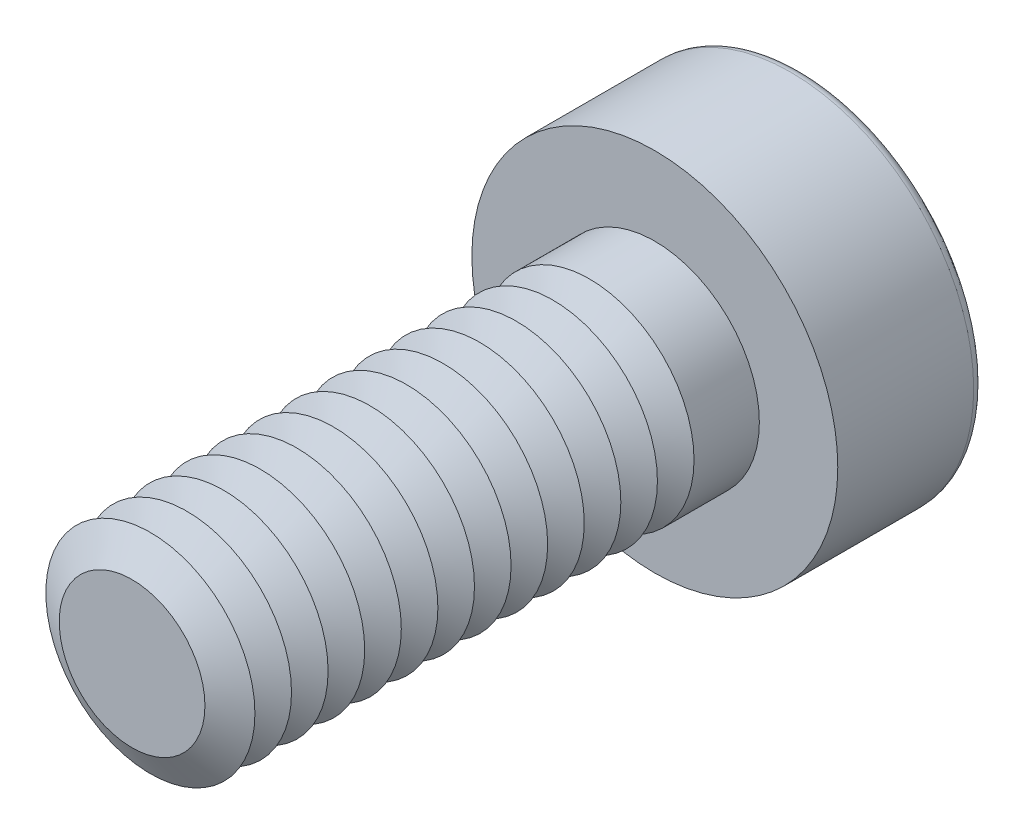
ISO-10303-21;
HEADER;
FILE_DESCRIPTION(('STEP AP214'),'2;1');
FILE_NAME('part.step','',(''),(''),'','','');
FILE_SCHEMA(('AUTOMOTIVE_DESIGN { 1 0 10303 214 1 1 1 1 }'));
ENDSEC;
DATA;
#1=APPLICATION_CONTEXT('core data for automotive mechanical design processes');
#2=APPLICATION_PROTOCOL_DEFINITION('international standard','automotive_design',2000,#1);
#3=PRODUCT_CONTEXT('',#1,'mechanical');
#4=PRODUCT('Part','Part','',(#3));
#5=PRODUCT_RELATED_PRODUCT_CATEGORY('part','',(#4));
#6=PRODUCT_DEFINITION_FORMATION('','',#4);
#7=PRODUCT_DEFINITION_CONTEXT('part definition',#1,'design');
#8=PRODUCT_DEFINITION('design','',#6,#7);
#9=PRODUCT_DEFINITION_SHAPE('','',#8);
#10=(LENGTH_UNIT() NAMED_UNIT(*) SI_UNIT(.MILLI.,.METRE.));
#11=(NAMED_UNIT(*) PLANE_ANGLE_UNIT() SI_UNIT($,.RADIAN.));
#12=(NAMED_UNIT(*) SI_UNIT($,.STERADIAN.) SOLID_ANGLE_UNIT());
#13=UNCERTAINTY_MEASURE_WITH_UNIT(LENGTH_MEASURE(1.E-05),#10,'distance_accuracy_value','');
#14=(GEOMETRIC_REPRESENTATION_CONTEXT(3) GLOBAL_UNCERTAINTY_ASSIGNED_CONTEXT((#13)) GLOBAL_UNIT_ASSIGNED_CONTEXT((#10,
#11,#12)) REPRESENTATION_CONTEXT('',''));
#15=CARTESIAN_POINT('',(0.,0.,0.));
#16=DIRECTION('',(0.,0.,1.));
#17=DIRECTION('',(1.,0.,0.));
#18=AXIS2_PLACEMENT_3D('',#15,#16,#17);
#19=CARTESIAN_POINT('',(0.,0.,7.55));
#20=DIRECTION('',(0.,0.,1.));
#21=DIRECTION('',(1.,0.,0.));
#22=AXIS2_PLACEMENT_3D('',#19,#20,#21);
#23=CONICAL_SURFACE('',#22,2.,1.0471975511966);
#24=CARTESIAN_POINT('',(0.,0.,7.2));
#25=DIRECTION('',(0.,0.,1.));
#26=DIRECTION('',(1.,0.,0.));
#27=AXIS2_PLACEMENT_3D('',#24,#25,#26);
#28=CIRCLE('',#27,1.39378221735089);
#29=CARTESIAN_POINT('',(1.39378221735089,0.,7.2));
#30=VERTEX_POINT('',#29);
#31=EDGE_CURVE('E314',#30,#30,#28,.T.);
#32=ORIENTED_EDGE('',*,*,#31,.T.);
#33=EDGE_LOOP('',(#32));
#34=FACE_BOUND('',#33,.T.);
#35=CARTESIAN_POINT('',(0.,0.,7.55));
#36=DIRECTION('',(0.,0.,1.));
#37=DIRECTION('',(1.,0.,0.));
#38=AXIS2_PLACEMENT_3D('',#35,#36,#37);
#39=CIRCLE('',#38,2.);
#40=CARTESIAN_POINT('',(2.,0.,7.55));
#41=VERTEX_POINT('',#40);
#42=EDGE_CURVE('E317',#41,#41,#39,.T.);
#43=ORIENTED_EDGE('',*,*,#42,.F.);
#44=EDGE_LOOP('',(#43));
#45=FACE_BOUND('',#44,.T.);
#46=ADVANCED_FACE('F39',(#34,#45),#23,.T.);
#47=CARTESIAN_POINT('',(0.,0.,7.2));
#48=DIRECTION('',(0.,0.,-1.));
#49=DIRECTION('',(-1.,0.,0.));
#50=AXIS2_PLACEMENT_3D('',#47,#48,#49);
#51=CONICAL_SURFACE('',#50,1.39378221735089,1.0471975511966);
#52=CARTESIAN_POINT('',(0.,0.,6.85));
#53=DIRECTION('',(0.,0.,1.));
#54=DIRECTION('',(1.,0.,0.));
#55=AXIS2_PLACEMENT_3D('',#52,#53,#54);
#56=CIRCLE('',#55,2.);
#57=CARTESIAN_POINT('',(2.,0.,6.85));
#58=VERTEX_POINT('',#57);
#59=EDGE_CURVE('E325',#58,#58,#56,.T.);
#60=ORIENTED_EDGE('',*,*,#59,.T.);
#61=EDGE_LOOP('',(#60));
#62=FACE_BOUND('',#61,.T.);
#63=ORIENTED_EDGE('',*,*,#31,.F.);
#64=EDGE_LOOP('',(#63));
#65=FACE_BOUND('',#64,.T.);
#66=ADVANCED_FACE('F245',(#62,#65),#51,.T.);
#67=CARTESIAN_POINT('',(0.,0.,10.));
#68=DIRECTION('',(0.,0.,1.));
#69=DIRECTION('',(1.,0.,0.));
#70=AXIS2_PLACEMENT_3D('',#67,#68,#69);
#71=PLANE('',#70);
#72=CARTESIAN_POINT('',(0.,0.,10.));
#73=DIRECTION('',(0.,0.,1.));
#74=DIRECTION('',(1.,0.,0.));
#75=AXIS2_PLACEMENT_3D('',#72,#73,#74);
#76=CIRCLE('',#75,1.39378221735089);
#77=CARTESIAN_POINT('',(1.39378221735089,0.,10.));
#78=VERTEX_POINT('',#77);
#79=EDGE_CURVE('E174',#78,#78,#76,.T.);
#80=ORIENTED_EDGE('',*,*,#79,.T.);
#81=EDGE_LOOP('',(#80));
#82=FACE_BOUND('',#81,.T.);
#83=ADVANCED_FACE('F251',(#82),#71,.T.);
#84=CARTESIAN_POINT('',(0.,0.,10.));
#85=DIRECTION('',(0.,0.,-1.));
#86=DIRECTION('',(-1.,0.,0.));
#87=AXIS2_PLACEMENT_3D('',#84,#85,#86);
#88=CONICAL_SURFACE('',#87,1.39378221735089,1.0471975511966);
#89=CARTESIAN_POINT('',(0.,0.,9.65));
#90=DIRECTION('',(0.,0.,1.));
#91=DIRECTION('',(1.,0.,0.));
#92=AXIS2_PLACEMENT_3D('',#89,#90,#91);
#93=CIRCLE('',#92,2.);
#94=CARTESIAN_POINT('',(2.,0.,9.65));
#95=VERTEX_POINT('',#94);
#96=EDGE_CURVE('E291',#95,#95,#93,.T.);
#97=ORIENTED_EDGE('',*,*,#96,.T.);
#98=EDGE_LOOP('',(#97));
#99=FACE_BOUND('',#98,.T.);
#100=ORIENTED_EDGE('',*,*,#79,.F.);
#101=EDGE_LOOP('',(#100));
#102=FACE_BOUND('',#101,.T.);
#103=ADVANCED_FACE('F199',(#99,#102),#88,.T.);
#104=CARTESIAN_POINT('',(0.,0.,9.65));
#105=DIRECTION('',(0.,0.,1.));
#106=DIRECTION('',(1.,0.,0.));
#107=AXIS2_PLACEMENT_3D('',#104,#105,#106);
#108=CONICAL_SURFACE('',#107,2.,1.0471975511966);
#109=CARTESIAN_POINT('',(0.,0.,9.3));
#110=DIRECTION('',(0.,0.,1.));
#111=DIRECTION('',(1.,0.,0.));
#112=AXIS2_PLACEMENT_3D('',#109,#110,#111);
#113=CIRCLE('',#112,1.39378221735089);
#114=CARTESIAN_POINT('',(1.39378221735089,0.,9.3));
#115=VERTEX_POINT('',#114);
#116=EDGE_CURVE('E288',#115,#115,#113,.T.);
#117=ORIENTED_EDGE('',*,*,#116,.T.);
#118=EDGE_LOOP('',(#117));
#119=FACE_BOUND('',#118,.T.);
#120=ORIENTED_EDGE('',*,*,#96,.F.);
#121=EDGE_LOOP('',(#120));
#122=FACE_BOUND('',#121,.T.);
#123=ADVANCED_FACE('F277',(#119,#122),#108,.T.);
#124=CARTESIAN_POINT('',(0.,0.,9.3));
#125=DIRECTION('',(0.,0.,-1.));
#126=DIRECTION('',(-1.,0.,0.));
#127=AXIS2_PLACEMENT_3D('',#124,#125,#126);
#128=CONICAL_SURFACE('',#127,1.39378221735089,1.0471975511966);
#129=CARTESIAN_POINT('',(0.,0.,8.95));
#130=DIRECTION('',(0.,0.,1.));
#131=DIRECTION('',(1.,0.,0.));
#132=AXIS2_PLACEMENT_3D('',#129,#130,#131);
#133=CIRCLE('',#132,2.);
#134=CARTESIAN_POINT('',(2.,0.,8.95));
#135=VERTEX_POINT('',#134);
#136=EDGE_CURVE('E300',#135,#135,#133,.T.);
#137=ORIENTED_EDGE('',*,*,#136,.T.);
#138=EDGE_LOOP('',(#137));
#139=FACE_BOUND('',#138,.T.);
#140=ORIENTED_EDGE('',*,*,#116,.F.);
#141=EDGE_LOOP('',(#140));
#142=FACE_BOUND('',#141,.T.);
#143=ADVANCED_FACE('F274',(#139,#142),#128,.T.);
#144=CARTESIAN_POINT('',(0.,0.,8.95));
#145=DIRECTION('',(0.,0.,1.));
#146=DIRECTION('',(1.,0.,0.));
#147=AXIS2_PLACEMENT_3D('',#144,#145,#146);
#148=CONICAL_SURFACE('',#147,2.,1.0471975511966);
#149=CARTESIAN_POINT('',(0.,0.,8.6));
#150=DIRECTION('',(0.,0.,1.));
#151=DIRECTION('',(1.,0.,0.));
#152=AXIS2_PLACEMENT_3D('',#149,#150,#151);
#153=CIRCLE('',#152,1.39378221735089);
#154=CARTESIAN_POINT('',(1.39378221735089,0.,8.6));
#155=VERTEX_POINT('',#154);
#156=EDGE_CURVE('E293',#155,#155,#153,.T.);
#157=ORIENTED_EDGE('',*,*,#156,.T.);
#158=EDGE_LOOP('',(#157));
#159=FACE_BOUND('',#158,.T.);
#160=ORIENTED_EDGE('',*,*,#136,.F.);
#161=EDGE_LOOP('',(#160));
#162=FACE_BOUND('',#161,.T.);
#163=ADVANCED_FACE('F270',(#159,#162),#148,.T.);
#164=CARTESIAN_POINT('',(0.,0.,8.6));
#165=DIRECTION('',(0.,0.,-1.));
#166=DIRECTION('',(-1.,0.,0.));
#167=AXIS2_PLACEMENT_3D('',#164,#165,#166);
#168=CONICAL_SURFACE('',#167,1.39378221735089,1.0471975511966);
#169=CARTESIAN_POINT('',(0.,0.,8.25));
#170=DIRECTION('',(0.,0.,1.));
#171=DIRECTION('',(1.,0.,0.));
#172=AXIS2_PLACEMENT_3D('',#169,#170,#171);
#173=CIRCLE('',#172,2.);
#174=CARTESIAN_POINT('',(2.,0.,8.25));
#175=VERTEX_POINT('',#174);
#176=EDGE_CURVE('E310',#175,#175,#173,.T.);
#177=ORIENTED_EDGE('',*,*,#176,.T.);
#178=EDGE_LOOP('',(#177));
#179=FACE_BOUND('',#178,.T.);
#180=ORIENTED_EDGE('',*,*,#156,.F.);
#181=EDGE_LOOP('',(#180));
#182=FACE_BOUND('',#181,.T.);
#183=ADVANCED_FACE('F266',(#179,#182),#168,.T.);
#184=CARTESIAN_POINT('',(0.,0.,8.25));
#185=DIRECTION('',(0.,0.,1.));
#186=DIRECTION('',(1.,0.,0.));
#187=AXIS2_PLACEMENT_3D('',#184,#185,#186);
#188=CONICAL_SURFACE('',#187,2.,1.0471975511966);
#189=CARTESIAN_POINT('',(0.,0.,7.9));
#190=DIRECTION('',(0.,0.,1.));
#191=DIRECTION('',(1.,0.,0.));
#192=AXIS2_PLACEMENT_3D('',#189,#190,#191);
#193=CIRCLE('',#192,1.39378221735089);
#194=CARTESIAN_POINT('',(1.39378221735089,0.,7.9));
#195=VERTEX_POINT('',#194);
#196=EDGE_CURVE('E306',#195,#195,#193,.T.);
#197=ORIENTED_EDGE('',*,*,#196,.T.);
#198=EDGE_LOOP('',(#197));
#199=FACE_BOUND('',#198,.T.);
#200=ORIENTED_EDGE('',*,*,#176,.F.);
#201=EDGE_LOOP('',(#200));
#202=FACE_BOUND('',#201,.T.);
#203=ADVANCED_FACE('F262',(#199,#202),#188,.T.);
#204=CARTESIAN_POINT('',(0.,0.,7.9));
#205=DIRECTION('',(0.,0.,-1.));
#206=DIRECTION('',(-1.,0.,0.));
#207=AXIS2_PLACEMENT_3D('',#204,#205,#206);
#208=CONICAL_SURFACE('',#207,1.39378221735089,1.0471975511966);
#209=ORIENTED_EDGE('',*,*,#42,.T.);
#210=EDGE_LOOP('',(#209));
#211=FACE_BOUND('',#210,.T.);
#212=ORIENTED_EDGE('',*,*,#196,.F.);
#213=EDGE_LOOP('',(#212));
#214=FACE_BOUND('',#213,.T.);
#215=ADVANCED_FACE('F258',(#211,#214),#208,.T.);
#216=CARTESIAN_POINT('',(0.,0.,6.85));
#217=DIRECTION('',(0.,0.,1.));
#218=DIRECTION('',(1.,0.,0.));
#219=AXIS2_PLACEMENT_3D('',#216,#217,#218);
#220=CONICAL_SURFACE('',#219,2.,1.0471975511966);
#221=CARTESIAN_POINT('',(0.,0.,6.5));
#222=DIRECTION('',(0.,0.,1.));
#223=DIRECTION('',(1.,0.,0.));
#224=AXIS2_PLACEMENT_3D('',#221,#222,#223);
#225=CIRCLE('',#224,1.39378221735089);
#226=CARTESIAN_POINT('',(1.39378221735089,0.,6.5));
#227=VERTEX_POINT('',#226);
#228=EDGE_CURVE('E321',#227,#227,#225,.T.);
#229=ORIENTED_EDGE('',*,*,#228,.T.);
#230=EDGE_LOOP('',(#229));
#231=FACE_BOUND('',#230,.T.);
#232=ORIENTED_EDGE('',*,*,#59,.F.);
#233=EDGE_LOOP('',(#232));
#234=FACE_BOUND('',#233,.T.);
#235=ADVANCED_FACE('F261',(#231,#234),#220,.T.);
#236=CARTESIAN_POINT('',(0.,0.,6.5));
#237=DIRECTION('',(0.,0.,-1.));
#238=DIRECTION('',(-1.,0.,0.));
#239=AXIS2_PLACEMENT_3D('',#236,#237,#238);
#240=CONICAL_SURFACE('',#239,1.39378221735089,1.0471975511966);
#241=CARTESIAN_POINT('',(0.,0.,6.15));
#242=DIRECTION('',(0.,0.,1.));
#243=DIRECTION('',(1.,0.,0.));
#244=AXIS2_PLACEMENT_3D('',#241,#242,#243);
#245=CIRCLE('',#244,2.);
#246=CARTESIAN_POINT('',(2.,0.,6.15));
#247=VERTEX_POINT('',#246);
#248=EDGE_CURVE('E333',#247,#247,#245,.T.);
#249=ORIENTED_EDGE('',*,*,#248,.T.);
#250=EDGE_LOOP('',(#249));
#251=FACE_BOUND('',#250,.T.);
#252=ORIENTED_EDGE('',*,*,#228,.F.);
#253=EDGE_LOOP('',(#252));
#254=FACE_BOUND('',#253,.T.);
#255=ADVANCED_FACE('F450',(#251,#254),#240,.T.);
#256=CARTESIAN_POINT('',(0.,0.,6.15));
#257=DIRECTION('',(0.,0.,1.));
#258=DIRECTION('',(1.,0.,0.));
#259=AXIS2_PLACEMENT_3D('',#256,#257,#258);
#260=CONICAL_SURFACE('',#259,2.,1.0471975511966);
#261=CARTESIAN_POINT('',(0.,0.,5.8));
#262=DIRECTION('',(0.,0.,1.));
#263=DIRECTION('',(1.,0.,0.));
#264=AXIS2_PLACEMENT_3D('',#261,#262,#263);
#265=CIRCLE('',#264,1.39378221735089);
#266=CARTESIAN_POINT('',(1.39378221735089,0.,5.8));
#267=VERTEX_POINT('',#266);
#268=EDGE_CURVE('E329',#267,#267,#265,.T.);
#269=ORIENTED_EDGE('',*,*,#268,.T.);
#270=EDGE_LOOP('',(#269));
#271=FACE_BOUND('',#270,.T.);
#272=ORIENTED_EDGE('',*,*,#248,.F.);
#273=EDGE_LOOP('',(#272));
#274=FACE_BOUND('',#273,.T.);
#275=ADVANCED_FACE('F446',(#271,#274),#260,.T.);
#276=CARTESIAN_POINT('',(0.,0.,5.8));
#277=DIRECTION('',(0.,0.,-1.));
#278=DIRECTION('',(-1.,0.,0.));
#279=AXIS2_PLACEMENT_3D('',#276,#277,#278);
#280=CONICAL_SURFACE('',#279,1.39378221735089,1.0471975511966);
#281=CARTESIAN_POINT('',(0.,0.,5.45));
#282=DIRECTION('',(0.,0.,1.));
#283=DIRECTION('',(1.,0.,0.));
#284=AXIS2_PLACEMENT_3D('',#281,#282,#283);
#285=CIRCLE('',#284,2.);
#286=CARTESIAN_POINT('',(2.,0.,5.45));
#287=VERTEX_POINT('',#286);
#288=EDGE_CURVE('E340',#287,#287,#285,.T.);
#289=ORIENTED_EDGE('',*,*,#288,.T.);
#290=EDGE_LOOP('',(#289));
#291=FACE_BOUND('',#290,.T.);
#292=ORIENTED_EDGE('',*,*,#268,.F.);
#293=EDGE_LOOP('',(#292));
#294=FACE_BOUND('',#293,.T.);
#295=ADVANCED_FACE('F442',(#291,#294),#280,.T.);
#296=CARTESIAN_POINT('',(0.,0.,5.45));
#297=DIRECTION('',(0.,0.,1.));
#298=DIRECTION('',(1.,0.,0.));
#299=AXIS2_PLACEMENT_3D('',#296,#297,#298);
#300=CONICAL_SURFACE('',#299,2.,1.0471975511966);
#301=CARTESIAN_POINT('',(0.,0.,5.1));
#302=DIRECTION('',(0.,0.,1.));
#303=DIRECTION('',(1.,0.,0.));
#304=AXIS2_PLACEMENT_3D('',#301,#302,#303);
#305=CIRCLE('',#304,1.39378221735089);
#306=CARTESIAN_POINT('',(1.39378221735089,0.,5.1));
#307=VERTEX_POINT('',#306);
#308=EDGE_CURVE('E336',#307,#307,#305,.T.);
#309=ORIENTED_EDGE('',*,*,#308,.T.);
#310=EDGE_LOOP('',(#309));
#311=FACE_BOUND('',#310,.T.);
#312=ORIENTED_EDGE('',*,*,#288,.F.);
#313=EDGE_LOOP('',(#312));
#314=FACE_BOUND('',#313,.T.);
#315=ADVANCED_FACE('F438',(#311,#314),#300,.T.);
#316=CARTESIAN_POINT('',(0.,0.,5.1));
#317=DIRECTION('',(0.,0.,-1.));
#318=DIRECTION('',(-1.,0.,0.));
#319=AXIS2_PLACEMENT_3D('',#316,#317,#318);
#320=CONICAL_SURFACE('',#319,1.39378221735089,1.0471975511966);
#321=CARTESIAN_POINT('',(0.,0.,4.75));
#322=DIRECTION('',(0.,0.,1.));
#323=DIRECTION('',(1.,0.,0.));
#324=AXIS2_PLACEMENT_3D('',#321,#322,#323);
#325=CIRCLE('',#324,2.);
#326=CARTESIAN_POINT('',(2.,0.,4.75));
#327=VERTEX_POINT('',#326);
#328=EDGE_CURVE('E348',#327,#327,#325,.T.);
#329=ORIENTED_EDGE('',*,*,#328,.T.);
#330=EDGE_LOOP('',(#329));
#331=FACE_BOUND('',#330,.T.);
#332=ORIENTED_EDGE('',*,*,#308,.F.);
#333=EDGE_LOOP('',(#332));
#334=FACE_BOUND('',#333,.T.);
#335=ADVANCED_FACE('F434',(#331,#334),#320,.T.);
#336=CARTESIAN_POINT('',(0.,0.,4.75));
#337=DIRECTION('',(0.,0.,1.));
#338=DIRECTION('',(1.,0.,0.));
#339=AXIS2_PLACEMENT_3D('',#336,#337,#338);
#340=CONICAL_SURFACE('',#339,2.,1.0471975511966);
#341=CARTESIAN_POINT('',(0.,0.,4.4));
#342=DIRECTION('',(0.,0.,1.));
#343=DIRECTION('',(1.,0.,0.));
#344=AXIS2_PLACEMENT_3D('',#341,#342,#343);
#345=CIRCLE('',#344,1.39378221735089);
#346=CARTESIAN_POINT('',(1.39378221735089,0.,4.4));
#347=VERTEX_POINT('',#346);
#348=EDGE_CURVE('E344',#347,#347,#345,.T.);
#349=ORIENTED_EDGE('',*,*,#348,.T.);
#350=EDGE_LOOP('',(#349));
#351=FACE_BOUND('',#350,.T.);
#352=ORIENTED_EDGE('',*,*,#328,.F.);
#353=EDGE_LOOP('',(#352));
#354=FACE_BOUND('',#353,.T.);
#355=ADVANCED_FACE('F430',(#351,#354),#340,.T.);
#356=CARTESIAN_POINT('',(0.,0.,4.4));
#357=DIRECTION('',(0.,0.,-1.));
#358=DIRECTION('',(-1.,0.,0.));
#359=AXIS2_PLACEMENT_3D('',#356,#357,#358);
#360=CONICAL_SURFACE('',#359,1.39378221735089,1.0471975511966);
#361=CARTESIAN_POINT('',(0.,0.,4.05));
#362=DIRECTION('',(0.,0.,1.));
#363=DIRECTION('',(1.,0.,0.));
#364=AXIS2_PLACEMENT_3D('',#361,#362,#363);
#365=CIRCLE('',#364,2.);
#366=CARTESIAN_POINT('',(2.,0.,4.05));
#367=VERTEX_POINT('',#366);
#368=EDGE_CURVE('E356',#367,#367,#365,.T.);
#369=ORIENTED_EDGE('',*,*,#368,.T.);
#370=EDGE_LOOP('',(#369));
#371=FACE_BOUND('',#370,.T.);
#372=ORIENTED_EDGE('',*,*,#348,.F.);
#373=EDGE_LOOP('',(#372));
#374=FACE_BOUND('',#373,.T.);
#375=ADVANCED_FACE('F426',(#371,#374),#360,.T.);
#376=CARTESIAN_POINT('',(0.,0.,4.05));
#377=DIRECTION('',(0.,0.,1.));
#378=DIRECTION('',(1.,0.,0.));
#379=AXIS2_PLACEMENT_3D('',#376,#377,#378);
#380=CONICAL_SURFACE('',#379,2.,1.0471975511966);
#381=CARTESIAN_POINT('',(0.,0.,3.7));
#382=DIRECTION('',(0.,0.,1.));
#383=DIRECTION('',(1.,0.,0.));
#384=AXIS2_PLACEMENT_3D('',#381,#382,#383);
#385=CIRCLE('',#384,1.39378221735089);
#386=CARTESIAN_POINT('',(1.39378221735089,0.,3.7));
#387=VERTEX_POINT('',#386);
#388=EDGE_CURVE('E352',#387,#387,#385,.T.);
#389=ORIENTED_EDGE('',*,*,#388,.T.);
#390=EDGE_LOOP('',(#389));
#391=FACE_BOUND('',#390,.T.);
#392=ORIENTED_EDGE('',*,*,#368,.F.);
#393=EDGE_LOOP('',(#392));
#394=FACE_BOUND('',#393,.T.);
#395=ADVANCED_FACE('F422',(#391,#394),#380,.T.);
#396=CARTESIAN_POINT('',(0.,0.,3.7));
#397=DIRECTION('',(0.,0.,-1.));
#398=DIRECTION('',(-1.,0.,0.));
#399=AXIS2_PLACEMENT_3D('',#396,#397,#398);
#400=CONICAL_SURFACE('',#399,1.39378221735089,1.0471975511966);
#401=CARTESIAN_POINT('',(0.,0.,3.35));
#402=DIRECTION('',(0.,0.,1.));
#403=DIRECTION('',(1.,0.,0.));
#404=AXIS2_PLACEMENT_3D('',#401,#402,#403);
#405=CIRCLE('',#404,2.);
#406=CARTESIAN_POINT('',(2.,0.,3.35));
#407=VERTEX_POINT('',#406);
#408=EDGE_CURVE('E364',#407,#407,#405,.T.);
#409=ORIENTED_EDGE('',*,*,#408,.T.);
#410=EDGE_LOOP('',(#409));
#411=FACE_BOUND('',#410,.T.);
#412=ORIENTED_EDGE('',*,*,#388,.F.);
#413=EDGE_LOOP('',(#412));
#414=FACE_BOUND('',#413,.T.);
#415=ADVANCED_FACE('F418',(#411,#414),#400,.T.);
#416=CARTESIAN_POINT('',(0.,0.,3.35));
#417=DIRECTION('',(0.,0.,1.));
#418=DIRECTION('',(1.,0.,0.));
#419=AXIS2_PLACEMENT_3D('',#416,#417,#418);
#420=CONICAL_SURFACE('',#419,2.,1.0471975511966);
#421=CARTESIAN_POINT('',(0.,0.,3.));
#422=DIRECTION('',(0.,0.,1.));
#423=DIRECTION('',(1.,0.,0.));
#424=AXIS2_PLACEMENT_3D('',#421,#422,#423);
#425=CIRCLE('',#424,1.39378221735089);
#426=CARTESIAN_POINT('',(1.39378221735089,0.,3.));
#427=VERTEX_POINT('',#426);
#428=EDGE_CURVE('E360',#427,#427,#425,.T.);
#429=ORIENTED_EDGE('',*,*,#428,.T.);
#430=EDGE_LOOP('',(#429));
#431=FACE_BOUND('',#430,.T.);
#432=ORIENTED_EDGE('',*,*,#408,.F.);
#433=EDGE_LOOP('',(#432));
#434=FACE_BOUND('',#433,.T.);
#435=ADVANCED_FACE('F414',(#431,#434),#420,.T.);
#436=CARTESIAN_POINT('',(0.,0.,3.));
#437=DIRECTION('',(0.,0.,-1.));
#438=DIRECTION('',(-1.,0.,0.));
#439=AXIS2_PLACEMENT_3D('',#436,#437,#438);
#440=CONICAL_SURFACE('',#439,1.39378221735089,1.0471975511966);
#441=CARTESIAN_POINT('',(0.,0.,2.65));
#442=DIRECTION('',(0.,0.,1.));
#443=DIRECTION('',(1.,0.,0.));
#444=AXIS2_PLACEMENT_3D('',#441,#442,#443);
#445=CIRCLE('',#444,2.);
#446=CARTESIAN_POINT('',(2.,0.,2.65));
#447=VERTEX_POINT('',#446);
#448=EDGE_CURVE('E372',#447,#447,#445,.T.);
#449=ORIENTED_EDGE('',*,*,#448,.T.);
#450=EDGE_LOOP('',(#449));
#451=FACE_BOUND('',#450,.T.);
#452=ORIENTED_EDGE('',*,*,#428,.F.);
#453=EDGE_LOOP('',(#452));
#454=FACE_BOUND('',#453,.T.);
#455=ADVANCED_FACE('F410',(#451,#454),#440,.T.);
#456=CARTESIAN_POINT('',(0.,0.,2.65));
#457=DIRECTION('',(0.,0.,1.));
#458=DIRECTION('',(1.,0.,0.));
#459=AXIS2_PLACEMENT_3D('',#456,#457,#458);
#460=CONICAL_SURFACE('',#459,2.,1.0471975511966);
#461=CARTESIAN_POINT('',(0.,0.,2.3));
#462=DIRECTION('',(0.,0.,1.));
#463=DIRECTION('',(1.,0.,0.));
#464=AXIS2_PLACEMENT_3D('',#461,#462,#463);
#465=CIRCLE('',#464,1.39378221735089);
#466=CARTESIAN_POINT('',(1.39378221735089,0.,2.3));
#467=VERTEX_POINT('',#466);
#468=EDGE_CURVE('E368',#467,#467,#465,.T.);
#469=ORIENTED_EDGE('',*,*,#468,.T.);
#470=EDGE_LOOP('',(#469));
#471=FACE_BOUND('',#470,.T.);
#472=ORIENTED_EDGE('',*,*,#448,.F.);
#473=EDGE_LOOP('',(#472));
#474=FACE_BOUND('',#473,.T.);
#475=ADVANCED_FACE('F405',(#471,#474),#460,.T.);
#476=CARTESIAN_POINT('',(0.,0.,2.3));
#477=DIRECTION('',(0.,0.,-1.));
#478=DIRECTION('',(-1.,0.,0.));
#479=AXIS2_PLACEMENT_3D('',#476,#477,#478);
#480=CONICAL_SURFACE('',#479,1.39378221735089,1.0471975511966);
#481=CARTESIAN_POINT('',(0.,0.,1.95));
#482=DIRECTION('',(0.,0.,1.));
#483=DIRECTION('',(1.,0.,0.));
#484=AXIS2_PLACEMENT_3D('',#481,#482,#483);
#485=CIRCLE('',#484,2.);
#486=CARTESIAN_POINT('',(2.,0.,1.95));
#487=VERTEX_POINT('',#486);
#488=EDGE_CURVE('E384',#487,#487,#485,.T.);
#489=ORIENTED_EDGE('',*,*,#488,.T.);
#490=EDGE_LOOP('',(#489));
#491=FACE_BOUND('',#490,.T.);
#492=ORIENTED_EDGE('',*,*,#468,.F.);
#493=EDGE_LOOP('',(#492));
#494=FACE_BOUND('',#493,.T.);
#495=ADVANCED_FACE('F391',(#491,#494),#480,.T.);
#496=CARTESIAN_POINT('',(0.,0.,1.95));
#497=DIRECTION('',(0.,0.,1.));
#498=DIRECTION('',(1.,0.,0.));
#499=AXIS2_PLACEMENT_3D('',#496,#497,#498);
#500=CONICAL_SURFACE('',#499,2.,1.0471975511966);
#501=CARTESIAN_POINT('',(0.,0.,1.6));
#502=DIRECTION('',(0.,0.,1.));
#503=DIRECTION('',(1.,0.,0.));
#504=AXIS2_PLACEMENT_3D('',#501,#502,#503);
#505=CIRCLE('',#504,1.39378221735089);
#506=CARTESIAN_POINT('',(1.39378221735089,0.,1.6));
#507=VERTEX_POINT('',#506);
#508=EDGE_CURVE('E376',#507,#507,#505,.T.);
#509=ORIENTED_EDGE('',*,*,#508,.T.);
#510=EDGE_LOOP('',(#509));
#511=FACE_BOUND('',#510,.T.);
#512=ORIENTED_EDGE('',*,*,#488,.F.);
#513=EDGE_LOOP('',(#512));
#514=FACE_BOUND('',#513,.T.);
#515=ADVANCED_FACE('F394',(#511,#514),#500,.T.);
#516=CARTESIAN_POINT('',(0.,0.,1.6));
#517=DIRECTION('',(0.,0.,-1.));
#518=DIRECTION('',(-1.,0.,0.));
#519=AXIS2_PLACEMENT_3D('',#516,#517,#518);
#520=CONICAL_SURFACE('',#519,1.39378221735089,1.0471975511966);
#521=CARTESIAN_POINT('',(0.,0.,1.25));
#522=DIRECTION('',(0.,0.,1.));
#523=DIRECTION('',(1.,0.,0.));
#524=AXIS2_PLACEMENT_3D('',#521,#522,#523);
#525=CIRCLE('',#524,2.);
#526=CARTESIAN_POINT('',(2.,0.,1.25));
#527=VERTEX_POINT('',#526);
#528=EDGE_CURVE('E380',#527,#527,#525,.T.);
#529=ORIENTED_EDGE('',*,*,#528,.T.);
#530=EDGE_LOOP('',(#529));
#531=FACE_BOUND('',#530,.T.);
#532=ORIENTED_EDGE('',*,*,#508,.F.);
#533=EDGE_LOOP('',(#532));
#534=FACE_BOUND('',#533,.T.);
#535=ADVANCED_FACE('F396',(#531,#534),#520,.T.);
#536=CARTESIAN_POINT('',(0.,0.,-0.925));
#537=DIRECTION('',(0.,0.,-1.));
#538=DIRECTION('',(-1.,0.,0.));
#539=AXIS2_PLACEMENT_3D('',#536,#537,#538);
#540=CONICAL_SURFACE('',#539,1.25,1.0471975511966);
#541=CARTESIAN_POINT('',(0.,0.,-0.203312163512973));
#542=VERTEX_POINT('',#541);
#543=VERTEX_LOOP('',#542);
#544=FACE_BOUND('',#543,.T.);
#545=CARTESIAN_POINT('',(0.,0.,-0.925));
#546=DIRECTION('',(0.,0.,-1.));
#547=DIRECTION('',(-1.,0.,0.));
#548=AXIS2_PLACEMENT_3D('',#545,#546,#547);
#549=CIRCLE('',#548,1.25);
#550=CARTESIAN_POINT('',(-1.08253175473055,0.624999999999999,-0.925));
#551=VERTEX_POINT('',#550);
#552=CARTESIAN_POINT('',(0.,1.25,-0.925));
#553=VERTEX_POINT('',#552);
#554=EDGE_CURVE('E149',#551,#553,#549,.T.);
#555=ORIENTED_EDGE('',*,*,#554,.T.);
#556=CARTESIAN_POINT('',(0.,0.,-0.925));
#557=DIRECTION('',(0.,0.,-1.));
#558=DIRECTION('',(-1.,0.,0.));
#559=AXIS2_PLACEMENT_3D('',#556,#557,#558);
#560=CIRCLE('',#559,1.25);
#561=CARTESIAN_POINT('',(1.08253175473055,0.625,-0.925));
#562=VERTEX_POINT('',#561);
#563=EDGE_CURVE('E54',#553,#562,#560,.T.);
#564=ORIENTED_EDGE('',*,*,#563,.T.);
#565=CARTESIAN_POINT('',(1.08253175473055,-0.624999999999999,-0.925));
#566=VERTEX_POINT('',#565);
#567=EDGE_CURVE('E909',#562,#566,#560,.T.);
#568=ORIENTED_EDGE('',*,*,#567,.T.);
#569=CARTESIAN_POINT('',(0.,-1.25,-0.925));
#570=VERTEX_POINT('',#569);
#571=EDGE_CURVE('E907',#566,#570,#560,.T.);
#572=ORIENTED_EDGE('',*,*,#571,.T.);
#573=CARTESIAN_POINT('',(-1.08253175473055,-0.624999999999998,-0.925));
#574=VERTEX_POINT('',#573);
#575=EDGE_CURVE('E901',#570,#574,#560,.T.);
#576=ORIENTED_EDGE('',*,*,#575,.T.);
#577=EDGE_CURVE('E899',#574,#551,#560,.T.);
#578=ORIENTED_EDGE('',*,*,#577,.T.);
#579=EDGE_LOOP('',(#555,#564,#568,#572,#576,#578));
#580=FACE_BOUND('',#579,.T.);
#581=ADVANCED_FACE('F201',(#544,#580),#540,.F.);
#582=CARTESIAN_POINT('',(0.,0.,-0.925));
#583=DIRECTION('',(0.,0.,-1.));
#584=DIRECTION('',(-1.,0.,0.));
#585=AXIS2_PLACEMENT_3D('',#582,#583,#584);
#586=PLANE('',#585);
#587=ORIENTED_EDGE('',*,*,#563,.F.);
#588=DIRECTION('',(1.,0.,0.));
#589=VECTOR('',#588,1.);
#590=CARTESIAN_POINT('',(-0.721687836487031,1.25,-0.925));
#591=LINE('',#590,#589);
#592=CARTESIAN_POINT('',(0.721687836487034,1.25,-0.925));
#593=VERTEX_POINT('',#592);
#594=EDGE_CURVE('E949',#553,#593,#591,.T.);
#595=ORIENTED_EDGE('',*,*,#594,.T.);
#596=DIRECTION('',(0.5,-0.866025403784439,0.));
#597=VECTOR('',#596,1.);
#598=CARTESIAN_POINT('',(0.721687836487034,1.25,-0.925));
#599=LINE('',#598,#597);
#600=EDGE_CURVE('E155',#593,#562,#599,.T.);
#601=ORIENTED_EDGE('',*,*,#600,.T.);
#602=EDGE_LOOP('',(#587,#595,#601));
#603=FACE_BOUND('',#602,.T.);
#604=ADVANCED_FACE('F521',(#603),#586,.T.);
#605=ORIENTED_EDGE('',*,*,#567,.F.);
#606=CARTESIAN_POINT('',(1.44337567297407,0.,-0.925));
#607=VERTEX_POINT('',#606);
#608=EDGE_CURVE('E944',#562,#607,#599,.T.);
#609=ORIENTED_EDGE('',*,*,#608,.T.);
#610=DIRECTION('',(-0.5,-0.866025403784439,0.));
#611=VECTOR('',#610,1.);
#612=CARTESIAN_POINT('',(1.44337567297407,0.,-0.925));
#613=LINE('',#612,#611);
#614=EDGE_CURVE('E921',#607,#566,#613,.T.);
#615=ORIENTED_EDGE('',*,*,#614,.T.);
#616=EDGE_LOOP('',(#605,#609,#615));
#617=FACE_BOUND('',#616,.T.);
#618=ADVANCED_FACE('F531',(#617),#586,.T.);
#619=ORIENTED_EDGE('',*,*,#571,.F.);
#620=CARTESIAN_POINT('',(0.721687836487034,-1.25,-0.925));
#621=VERTEX_POINT('',#620);
#622=EDGE_CURVE('E923',#566,#621,#613,.T.);
#623=ORIENTED_EDGE('',*,*,#622,.T.);
#624=DIRECTION('',(-1.,0.,0.));
#625=VECTOR('',#624,1.);
#626=CARTESIAN_POINT('',(0.721687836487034,-1.25,-0.925));
#627=LINE('',#626,#625);
#628=EDGE_CURVE('E874',#621,#570,#627,.T.);
#629=ORIENTED_EDGE('',*,*,#628,.T.);
#630=EDGE_LOOP('',(#619,#623,#629));
#631=FACE_BOUND('',#630,.T.);
#632=ADVANCED_FACE('F541',(#631),#586,.T.);
#633=ORIENTED_EDGE('',*,*,#575,.F.);
#634=CARTESIAN_POINT('',(-0.721687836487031,-1.25,-0.925));
#635=VERTEX_POINT('',#634);
#636=EDGE_CURVE('E917',#570,#635,#627,.T.);
#637=ORIENTED_EDGE('',*,*,#636,.T.);
#638=DIRECTION('',(-0.499999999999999,0.866025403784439,0.));
#639=VECTOR('',#638,1.);
#640=CARTESIAN_POINT('',(-0.721687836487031,-1.25,-0.925));
#641=LINE('',#640,#639);
#642=EDGE_CURVE('E919',#635,#574,#641,.T.);
#643=ORIENTED_EDGE('',*,*,#642,.T.);
#644=EDGE_LOOP('',(#633,#637,#643));
#645=FACE_BOUND('',#644,.T.);
#646=ADVANCED_FACE('F549',(#645),#586,.T.);
#647=ORIENTED_EDGE('',*,*,#577,.F.);
#648=CARTESIAN_POINT('',(-1.44337567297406,0.,-0.925));
#649=VERTEX_POINT('',#648);
#650=EDGE_CURVE('E925',#574,#649,#641,.T.);
#651=ORIENTED_EDGE('',*,*,#650,.T.);
#652=DIRECTION('',(0.499999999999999,0.866025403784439,0.));
#653=VECTOR('',#652,1.);
#654=CARTESIAN_POINT('',(-1.44337567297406,0.,-0.925));
#655=LINE('',#654,#653);
#656=EDGE_CURVE('E158',#649,#551,#655,.T.);
#657=ORIENTED_EDGE('',*,*,#656,.T.);
#658=EDGE_LOOP('',(#647,#651,#657));
#659=FACE_BOUND('',#658,.T.);
#660=ADVANCED_FACE('F231',(#659),#586,.T.);
#661=ORIENTED_EDGE('',*,*,#554,.F.);
#662=CARTESIAN_POINT('',(-0.721687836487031,1.25,-0.925));
#663=VERTEX_POINT('',#662);
#664=EDGE_CURVE('E932',#551,#663,#655,.T.);
#665=ORIENTED_EDGE('',*,*,#664,.T.);
#666=EDGE_CURVE('E945',#663,#553,#591,.T.);
#667=ORIENTED_EDGE('',*,*,#666,.T.);
#668=EDGE_LOOP('',(#661,#665,#667));
#669=FACE_BOUND('',#668,.T.);
#670=ADVANCED_FACE('F533',(#669),#586,.T.);
#671=CARTESIAN_POINT('',(-0.721687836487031,1.25,-0.925));
#672=DIRECTION('',(0.,1.,0.));
#673=DIRECTION('',(0.,0.,1.));
#674=AXIS2_PLACEMENT_3D('',#671,#672,#673);
#675=PLANE('',#674);
#676=DIRECTION('',(0.,0.,-1.));
#677=VECTOR('',#676,1.);
#678=CARTESIAN_POINT('',(-0.721687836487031,1.25,-0.925));
#679=LINE('',#678,#677);
#680=CARTESIAN_POINT('',(-0.721687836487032,1.25,-2.8));
#681=VERTEX_POINT('',#680);
#682=EDGE_CURVE('E147',#663,#681,#679,.T.);
#683=ORIENTED_EDGE('',*,*,#682,.T.);
#684=CARTESIAN_POINT('',(-1.88400474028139,1.25,-3.01907305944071));
#685=CARTESIAN_POINT('',(-1.82756112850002,1.25,-3.00647265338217));
#686=CARTESIAN_POINT('',(-1.77108164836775,1.25,-2.99403280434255));
#687=CARTESIAN_POINT('',(-1.65803301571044,1.25,-2.969555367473));
#688=CARTESIAN_POINT('',(-1.60146385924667,1.25,-2.95751779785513));
#689=CARTESIAN_POINT('',(-1.43148763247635,1.25,-2.92210797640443));
#690=CARTESIAN_POINT('',(-1.31792638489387,1.25,-2.89946453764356));
#691=CARTESIAN_POINT('',(-1.09123200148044,1.25,-2.85732379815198));
#692=CARTESIAN_POINT('',(-0.978103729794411,1.25,-2.83780085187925));
#693=CARTESIAN_POINT('',(-0.75117023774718,1.25,-2.80320860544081));
#694=CARTESIAN_POINT('',(-0.637365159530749,1.25,-2.78813840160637));
#695=CARTESIAN_POINT('',(-0.407744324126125,1.25,-2.76441002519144));
#696=CARTESIAN_POINT('',(-0.291920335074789,1.25,-2.7558257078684));
#697=CARTESIAN_POINT('',(-0.117976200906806,1.25,-2.74931804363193));
#698=CARTESIAN_POINT('',(-0.0599690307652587,1.25,-2.74820997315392));
#699=CARTESIAN_POINT('',(0.0560463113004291,1.25,-2.74816114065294));
#700=CARTESIAN_POINT('',(0.114054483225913,1.25,-2.74922038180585));
#701=CARTESIAN_POINT('',(0.288428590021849,1.25,-2.75560214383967));
#702=CARTESIAN_POINT('',(0.404683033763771,1.25,-2.76414565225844));
#703=CARTESIAN_POINT('',(0.636524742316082,1.25,-2.78800009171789));
#704=CARTESIAN_POINT('',(0.752111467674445,1.25,-2.80331588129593));
#705=CARTESIAN_POINT('',(0.985585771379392,1.25,-2.83897937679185));
#706=CARTESIAN_POINT('',(1.10345418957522,1.25,-2.85944851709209));
#707=CARTESIAN_POINT('',(1.3386179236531,1.25,-2.90348104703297));
#708=CARTESIAN_POINT('',(1.45591314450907,1.25,-2.92704493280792));
#709=CARTESIAN_POINT('',(1.69011362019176,1.25,-2.97617760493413));
#710=CARTESIAN_POINT('',(1.80701875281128,1.25,-3.00174696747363));
#711=CARTESIAN_POINT('',(2.04053091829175,1.25,-3.05421495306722));
#712=CARTESIAN_POINT('',(2.15713794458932,1.25,-3.08111360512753));
#713=CARTESIAN_POINT('',(2.38871499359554,1.25,-3.13548950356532));
#714=CARTESIAN_POINT('',(2.50368762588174,1.25,-3.16295568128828));
#715=CARTESIAN_POINT('',(2.73348169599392,1.25,-3.21852313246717));
#716=CARTESIAN_POINT('',(2.84830313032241,1.25,-3.2466244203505));
#717=CARTESIAN_POINT('',(3.07767157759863,1.25,-3.3032502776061));
#718=CARTESIAN_POINT('',(3.19221874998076,1.25,-3.33177420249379));
#719=CARTESIAN_POINT('',(3.4212203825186,1.25,-3.38917462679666));
#720=CARTESIAN_POINT('',(3.53567484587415,1.25,-3.41805111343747));
#721=CARTESIAN_POINT('',(3.65009781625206,1.25,-3.44705046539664));
#722=B_SPLINE_CURVE_WITH_KNOTS('',3,(#684,#685,#686,#687,#688,#689,#690,#691,#692,#693,#694,
#695,#696,#697,#698,#699,#700,#701,#702,#703,#704,#705,#706,#707,#708,#709,#710,#711,#712,#713,
#714,#715,#716,#717,#718,#719,#720,#721),.UNSPECIFIED.,.F.,.F.,(4,2,2,2,2,2,2,2,2,2,2,2,2,2,2,2,
2,2,4),(0.,0.173498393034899,0.347004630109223,0.694369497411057,1.03871380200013,
1.38298817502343,1.73112607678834,1.90514173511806,2.07915764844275,2.42857002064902,
2.77823347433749,3.13706733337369,3.49595878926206,3.85495373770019,4.21395652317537,
4.56857767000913,4.92320688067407,5.27734186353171,5.63146405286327),.UNSPECIFIED.);
#723=CARTESIAN_POINT('',(0.721687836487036,1.25,-2.8));
#724=VERTEX_POINT('',#723);
#725=EDGE_CURVE('E124',#681,#724,#722,.T.);
#726=ORIENTED_EDGE('',*,*,#725,.T.);
#727=DIRECTION('',(0.,0.,-1.));
#728=VECTOR('',#727,1.);
#729=CARTESIAN_POINT('',(0.721687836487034,1.25,-0.925));
#730=LINE('',#729,#728);
#731=EDGE_CURVE('E143',#593,#724,#730,.T.);
#732=ORIENTED_EDGE('',*,*,#731,.F.);
#733=ORIENTED_EDGE('',*,*,#594,.F.);
#734=ORIENTED_EDGE('',*,*,#666,.F.);
#735=EDGE_LOOP('',(#683,#726,#732,#733,#734));
#736=FACE_BOUND('',#735,.T.);
#737=ADVANCED_FACE('F141',(#736),#675,.F.);
#738=CARTESIAN_POINT('',(0.721687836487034,1.25,-0.925));
#739=DIRECTION('',(0.866025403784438,0.5,0.));
#740=DIRECTION('',(-0.5,0.866025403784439,0.));
#741=AXIS2_PLACEMENT_3D('',#738,#739,#740);
#742=PLANE('',#741);
#743=ORIENTED_EDGE('',*,*,#731,.T.);
#744=CARTESIAN_POINT('',(0.721572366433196,1.2502,-2.80003094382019));
#745=CARTESIAN_POINT('',(0.751551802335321,1.19827409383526,-2.79199301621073));
#746=CARTESIAN_POINT('',(0.781585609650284,1.14625401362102,-2.78469578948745));
#747=CARTESIAN_POINT('',(0.841759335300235,1.04203006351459,-2.7718751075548));
#748=CARTESIAN_POINT('',(0.871899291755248,0.989826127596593,-2.76635237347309));
#749=CARTESIAN_POINT('',(0.932102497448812,0.88555111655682,-2.75740321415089));
#750=CARTESIAN_POINT('',(0.962165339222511,0.83348074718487,-2.75396611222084));
#751=CARTESIAN_POINT('',(1.0223293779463,0.729273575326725,-2.7493572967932));
#752=CARTESIAN_POINT('',(1.05243056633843,0.677136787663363,-2.74818514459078));
#753=CARTESIAN_POINT('',(1.11263294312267,0.572863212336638,-2.74818514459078));
#754=CARTESIAN_POINT('',(1.1427341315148,0.520726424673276,-2.7493572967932));
#755=CARTESIAN_POINT('',(1.20289817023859,0.416519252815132,-2.75396611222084));
#756=CARTESIAN_POINT('',(1.23296101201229,0.364448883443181,-2.75740321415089));
#757=CARTESIAN_POINT('',(1.29316421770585,0.260173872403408,-2.76635237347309));
#758=CARTESIAN_POINT('',(1.32330417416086,0.207969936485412,-2.7718751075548));
#759=CARTESIAN_POINT('',(1.38347789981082,0.103745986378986,-2.78469578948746));
#760=CARTESIAN_POINT('',(1.41351170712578,0.0517259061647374,-2.79199301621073));
#761=CARTESIAN_POINT('',(1.4434911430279,-0.00019999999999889,-2.80003094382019));
#762=B_SPLINE_CURVE_WITH_KNOTS('',3,(#744,#745,#746,#747,#748,#749,#750,#751,#752,#753,#754,
#755,#756,#757,#758,#759,#760,#761),.UNSPECIFIED.,.F.,.F.,(4,2,2,2,2,2,2,2,4),(0.,
0.18149525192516,0.363064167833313,0.543695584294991,0.724292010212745,0.904888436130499,
1.08551985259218,1.26708876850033,1.44858402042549),.UNSPECIFIED.);
#763=CARTESIAN_POINT('',(1.44337567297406,0.,-2.8));
#764=VERTEX_POINT('',#763);
#765=EDGE_CURVE('E11',#724,#764,#762,.T.);
#766=ORIENTED_EDGE('',*,*,#765,.T.);
#767=DIRECTION('',(0.,0.,-1.));
#768=VECTOR('',#767,1.);
#769=CARTESIAN_POINT('',(1.44337567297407,0.,-0.925));
#770=LINE('',#769,#768);
#771=EDGE_CURVE('E157',#607,#764,#770,.T.);
#772=ORIENTED_EDGE('',*,*,#771,.F.);
#773=ORIENTED_EDGE('',*,*,#608,.F.);
#774=ORIENTED_EDGE('',*,*,#600,.F.);
#775=EDGE_LOOP('',(#743,#766,#772,#773,#774));
#776=FACE_BOUND('',#775,.T.);
#777=ADVANCED_FACE('F152',(#776),#742,.F.);
#778=CARTESIAN_POINT('',(1.44337567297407,0.,-0.925));
#779=DIRECTION('',(0.866025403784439,-0.5,0.));
#780=DIRECTION('',(0.5,0.866025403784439,0.));
#781=AXIS2_PLACEMENT_3D('',#778,#779,#780);
#782=PLANE('',#781);
#783=ORIENTED_EDGE('',*,*,#771,.T.);
#784=CARTESIAN_POINT('',(1.4434911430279,0.000200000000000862,-2.80003094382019));
#785=CARTESIAN_POINT('',(1.41351170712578,-0.0517259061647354,-2.79199301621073));
#786=CARTESIAN_POINT('',(1.38347789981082,-0.103745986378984,-2.78469578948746));
#787=CARTESIAN_POINT('',(1.32330417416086,-0.20796993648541,-2.7718751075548));
#788=CARTESIAN_POINT('',(1.29316421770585,-0.260173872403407,-2.76635237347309));
#789=CARTESIAN_POINT('',(1.23296101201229,-0.364448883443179,-2.75740321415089));
#790=CARTESIAN_POINT('',(1.20289817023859,-0.41651925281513,-2.75396611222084));
#791=CARTESIAN_POINT('',(1.1427341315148,-0.520726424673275,-2.7493572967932));
#792=CARTESIAN_POINT('',(1.11263294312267,-0.572863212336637,-2.74818514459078));
#793=CARTESIAN_POINT('',(1.05243056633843,-0.677136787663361,-2.74818514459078));
#794=CARTESIAN_POINT('',(1.0223293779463,-0.729273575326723,-2.7493572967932));
#795=CARTESIAN_POINT('',(0.962165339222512,-0.833480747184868,-2.75396611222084));
#796=CARTESIAN_POINT('',(0.932102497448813,-0.885551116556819,-2.75740321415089));
#797=CARTESIAN_POINT('',(0.871899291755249,-0.989826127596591,-2.76635237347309));
#798=CARTESIAN_POINT('',(0.841759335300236,-1.04203006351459,-2.7718751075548));
#799=CARTESIAN_POINT('',(0.781585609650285,-1.14625401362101,-2.78469578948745));
#800=CARTESIAN_POINT('',(0.751551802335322,-1.19827409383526,-2.79199301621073));
#801=CARTESIAN_POINT('',(0.721572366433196,-1.2502,-2.80003094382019));
#802=B_SPLINE_CURVE_WITH_KNOTS('',3,(#784,#785,#786,#787,#788,#789,#790,#791,#792,#793,#794,
#795,#796,#797,#798,#799,#800,#801),.UNSPECIFIED.,.F.,.F.,(4,2,2,2,2,2,2,2,4),(0.,
0.18149525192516,0.363064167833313,0.543695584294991,0.724292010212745,0.904888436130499,
1.08551985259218,1.26708876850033,1.44858402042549),.UNSPECIFIED.);
#803=CARTESIAN_POINT('',(0.721687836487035,-1.25,-2.8));
#804=VERTEX_POINT('',#803);
#805=EDGE_CURVE('E173',#764,#804,#802,.T.);
#806=ORIENTED_EDGE('',*,*,#805,.T.);
#807=DIRECTION('',(0.,0.,-1.));
#808=VECTOR('',#807,1.);
#809=CARTESIAN_POINT('',(0.721687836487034,-1.25,-0.925));
#810=LINE('',#809,#808);
#811=EDGE_CURVE('E869',#621,#804,#810,.T.);
#812=ORIENTED_EDGE('',*,*,#811,.F.);
#813=ORIENTED_EDGE('',*,*,#622,.F.);
#814=ORIENTED_EDGE('',*,*,#614,.F.);
#815=EDGE_LOOP('',(#783,#806,#812,#813,#814));
#816=FACE_BOUND('',#815,.T.);
#817=ADVANCED_FACE('F191',(#816),#782,.F.);
#818=CARTESIAN_POINT('',(0.721687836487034,-1.25,-0.925));
#819=DIRECTION('',(0.,-1.,0.));
#820=DIRECTION('',(1.,0.,0.));
#821=AXIS2_PLACEMENT_3D('',#818,#819,#820);
#822=PLANE('',#821);
#823=ORIENTED_EDGE('',*,*,#811,.T.);
#824=CARTESIAN_POINT('',(-1.88400474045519,-1.25,-3.01907305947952));
#825=CARTESIAN_POINT('',(-1.8275611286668,-1.25,-3.00647265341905));
#826=CARTESIAN_POINT('',(-1.77108164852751,-1.25,-2.99403280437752));
#827=CARTESIAN_POINT('',(-1.65803301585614,-1.25,-2.96955536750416));
#828=CARTESIAN_POINT('',(-1.60146385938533,-1.25,-2.95751779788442));
#829=CARTESIAN_POINT('',(-1.43148763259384,-1.25,-2.92210797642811));
#830=CARTESIAN_POINT('',(-1.3179263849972,-1.25,-2.89946453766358));
#831=CARTESIAN_POINT('',(-1.09123200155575,-1.25,-2.85732379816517));
#832=CARTESIAN_POINT('',(-0.978103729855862,-1.25,-2.83780085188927));
#833=CARTESIAN_POINT('',(-0.751170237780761,-1.25,-2.80320860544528));
#834=CARTESIAN_POINT('',(-0.637365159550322,-1.25,-2.78813840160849));
#835=CARTESIAN_POINT('',(-0.407744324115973,-1.25,-2.76441002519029));
#836=CARTESIAN_POINT('',(-0.29192033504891,-1.25,-2.75582570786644));
#837=CARTESIAN_POINT('',(-0.117976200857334,-1.25,-2.74931804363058));
#838=CARTESIAN_POINT('',(-0.0599690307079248,-1.25,-2.74820997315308));
#839=CARTESIAN_POINT('',(0.0560463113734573,-1.25,-2.74816114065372));
#840=CARTESIAN_POINT('',(0.114054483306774,-1.25,-2.74922038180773));
#841=CARTESIAN_POINT('',(0.288428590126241,-1.25,-2.75560214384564));
#842=CARTESIAN_POINT('',(0.404683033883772,-1.25,-2.76414565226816));
#843=CARTESIAN_POINT('',(0.636524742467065,-1.25,-2.78800009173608));
#844=CARTESIAN_POINT('',(0.752111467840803,-1.25,-2.80331588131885));
#845=CARTESIAN_POINT('',(0.985585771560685,-1.25,-2.8389793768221));
#846=CARTESIAN_POINT('',(1.10345418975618,-1.25,-2.8594485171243));
#847=CARTESIAN_POINT('',(1.33861792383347,-1.25,-2.90348104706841));
#848=CARTESIAN_POINT('',(1.45591314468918,-1.25,-2.92704493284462));
#849=CARTESIAN_POINT('',(1.69011362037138,-1.25,-2.9761776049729));
#850=CARTESIAN_POINT('',(1.80701875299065,-1.25,-3.00174696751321));
#851=CARTESIAN_POINT('',(2.04053091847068,-1.25,-3.05421495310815));
#852=CARTESIAN_POINT('',(2.15713794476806,-1.25,-3.081113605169));
#853=CARTESIAN_POINT('',(2.38871499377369,-1.25,-3.13548950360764));
#854=CARTESIAN_POINT('',(2.50368762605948,-1.25,-3.16295568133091));
#855=CARTESIAN_POINT('',(2.7334816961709,-1.25,-3.21852313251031));
#856=CARTESIAN_POINT('',(2.84830313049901,-1.25,-3.24662442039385));
#857=CARTESIAN_POINT('',(3.07767157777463,-1.25,-3.30325027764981));
#858=CARTESIAN_POINT('',(3.19221875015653,-1.25,-3.33177420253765));
#859=CARTESIAN_POINT('',(3.42122038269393,-1.25,-3.38917462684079));
#860=CARTESIAN_POINT('',(3.53567484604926,-1.25,-3.41805111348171));
#861=CARTESIAN_POINT('',(3.65009781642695,-1.25,-3.44705046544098));
#862=B_SPLINE_CURVE_WITH_KNOTS('',3,(#824,#825,#826,#827,#828,#829,#830,#831,#832,#833,#834,
#835,#836,#837,#838,#839,#840,#841,#842,#843,#844,#845,#846,#847,#848,#849,#850,#851,#852,#853,
#854,#855,#856,#857,#858,#859,#860,#861),.UNSPECIFIED.,.F.,.F.,(4,2,2,2,2,2,2,2,2,2,2,2,2,2,2,2,
2,2,4),(0.,0.173498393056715,0.347004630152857,0.694369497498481,1.03871380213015,
1.382988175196,1.73112607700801,1.90514173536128,2.0791576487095,2.42857002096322,
2.77823347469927,3.13706733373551,3.49595878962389,3.85495373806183,4.2139565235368,
4.56857767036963,4.92320688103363,5.27734186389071,5.63146405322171),.UNSPECIFIED.);
#863=CARTESIAN_POINT('',(-0.721687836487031,-1.25,-2.8));
#864=VERTEX_POINT('',#863);
#865=EDGE_CURVE('E184',#804,#864,#862,.F.);
#866=ORIENTED_EDGE('',*,*,#865,.T.);
#867=DIRECTION('',(0.,0.,-1.));
#868=VECTOR('',#867,1.);
#869=CARTESIAN_POINT('',(-0.721687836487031,-1.25,-0.925));
#870=LINE('',#869,#868);
#871=EDGE_CURVE('E876',#635,#864,#870,.T.);
#872=ORIENTED_EDGE('',*,*,#871,.F.);
#873=ORIENTED_EDGE('',*,*,#636,.F.);
#874=ORIENTED_EDGE('',*,*,#628,.F.);
#875=EDGE_LOOP('',(#823,#866,#872,#873,#874));
#876=FACE_BOUND('',#875,.T.);
#877=ADVANCED_FACE('F234',(#876),#822,.F.);
#878=CARTESIAN_POINT('',(-0.721687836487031,-1.25,-0.925));
#879=DIRECTION('',(-0.866025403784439,-0.499999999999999,0.));
#880=DIRECTION('',(0.5,-0.866025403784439,0.));
#881=AXIS2_PLACEMENT_3D('',#878,#879,#880);
#882=PLANE('',#881);
#883=ORIENTED_EDGE('',*,*,#871,.T.);
#884=CARTESIAN_POINT('',(-0.721572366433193,-1.2502,-2.80003094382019));
#885=CARTESIAN_POINT('',(-0.751551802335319,-1.19827409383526,-2.79199301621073));
#886=CARTESIAN_POINT('',(-0.781585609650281,-1.14625401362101,-2.78469578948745));
#887=CARTESIAN_POINT('',(-0.841759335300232,-1.04203006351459,-2.7718751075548));
#888=CARTESIAN_POINT('',(-0.871899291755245,-0.989826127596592,-2.76635237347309));
#889=CARTESIAN_POINT('',(-0.932102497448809,-0.88555111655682,-2.75740321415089));
#890=CARTESIAN_POINT('',(-0.962165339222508,-0.833480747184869,-2.75396611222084));
#891=CARTESIAN_POINT('',(-1.0223293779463,-0.729273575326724,-2.7493572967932));
#892=CARTESIAN_POINT('',(-1.05243056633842,-0.677136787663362,-2.74818514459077));
#893=CARTESIAN_POINT('',(-1.11263294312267,-0.572863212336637,-2.74818514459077));
#894=CARTESIAN_POINT('',(-1.1427341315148,-0.520726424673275,-2.7493572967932));
#895=CARTESIAN_POINT('',(-1.20289817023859,-0.41651925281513,-2.75396611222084));
#896=CARTESIAN_POINT('',(-1.23296101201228,-0.364448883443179,-2.75740321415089));
#897=CARTESIAN_POINT('',(-1.29316421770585,-0.260173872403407,-2.76635237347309));
#898=CARTESIAN_POINT('',(-1.32330417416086,-0.207969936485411,-2.7718751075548));
#899=CARTESIAN_POINT('',(-1.38347789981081,-0.103745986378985,-2.78469578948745));
#900=CARTESIAN_POINT('',(-1.41351170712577,-0.0517259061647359,-2.79199301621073));
#901=CARTESIAN_POINT('',(-1.4434911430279,0.000200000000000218,-2.80003094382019));
#902=B_SPLINE_CURVE_WITH_KNOTS('',3,(#884,#885,#886,#887,#888,#889,#890,#891,#892,#893,#894,
#895,#896,#897,#898,#899,#900,#901),.UNSPECIFIED.,.F.,.F.,(4,2,2,2,2,2,2,2,4),(0.,
0.18149525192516,0.363064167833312,0.543695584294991,0.724292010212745,0.904888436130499,
1.08551985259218,1.26708876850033,1.44858402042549),.UNSPECIFIED.);
#903=CARTESIAN_POINT('',(-1.44337567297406,0.,-2.8));
#904=VERTEX_POINT('',#903);
#905=EDGE_CURVE('E208',#864,#904,#902,.T.);
#906=ORIENTED_EDGE('',*,*,#905,.T.);
#907=DIRECTION('',(0.,0.,-1.));
#908=VECTOR('',#907,1.);
#909=CARTESIAN_POINT('',(-1.44337567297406,0.,-0.925));
#910=LINE('',#909,#908);
#911=EDGE_CURVE('E879',#649,#904,#910,.T.);
#912=ORIENTED_EDGE('',*,*,#911,.F.);
#913=ORIENTED_EDGE('',*,*,#650,.F.);
#914=ORIENTED_EDGE('',*,*,#642,.F.);
#915=EDGE_LOOP('',(#883,#906,#912,#913,#914));
#916=FACE_BOUND('',#915,.T.);
#917=ADVANCED_FACE('F229',(#916),#882,.F.);
#918=CARTESIAN_POINT('',(-1.44337567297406,0.,-0.925));
#919=DIRECTION('',(-0.866025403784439,0.499999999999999,0.));
#920=DIRECTION('',(-0.5,-0.866025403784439,0.));
#921=AXIS2_PLACEMENT_3D('',#918,#919,#920);
#922=PLANE('',#921);
#923=ORIENTED_EDGE('',*,*,#911,.T.);
#924=CARTESIAN_POINT('',(-1.4434911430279,-0.000199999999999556,-2.80003094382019));
#925=CARTESIAN_POINT('',(-1.41351170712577,0.0517259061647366,-2.79199301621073));
#926=CARTESIAN_POINT('',(-1.38347789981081,0.103745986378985,-2.78469578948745));
#927=CARTESIAN_POINT('',(-1.32330417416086,0.207969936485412,-2.7718751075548));
#928=CARTESIAN_POINT('',(-1.29316421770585,0.260173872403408,-2.76635237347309));
#929=CARTESIAN_POINT('',(-1.23296101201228,0.36444888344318,-2.75740321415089));
#930=CARTESIAN_POINT('',(-1.20289817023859,0.416519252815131,-2.75396611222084));
#931=CARTESIAN_POINT('',(-1.1427341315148,0.520726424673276,-2.7493572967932));
#932=CARTESIAN_POINT('',(-1.11263294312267,0.572863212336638,-2.74818514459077));
#933=CARTESIAN_POINT('',(-1.05243056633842,0.677136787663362,-2.74818514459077));
#934=CARTESIAN_POINT('',(-1.0223293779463,0.729273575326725,-2.7493572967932));
#935=CARTESIAN_POINT('',(-0.962165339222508,0.833480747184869,-2.75396611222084));
#936=CARTESIAN_POINT('',(-0.932102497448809,0.88555111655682,-2.75740321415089));
#937=CARTESIAN_POINT('',(-0.871899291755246,0.989826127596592,-2.76635237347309));
#938=CARTESIAN_POINT('',(-0.841759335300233,1.04203006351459,-2.7718751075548));
#939=CARTESIAN_POINT('',(-0.781585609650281,1.14625401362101,-2.78469578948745));
#940=CARTESIAN_POINT('',(-0.751551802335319,1.19827409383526,-2.79199301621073));
#941=CARTESIAN_POINT('',(-0.721572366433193,1.2502,-2.80003094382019));
#942=B_SPLINE_CURVE_WITH_KNOTS('',3,(#924,#925,#926,#927,#928,#929,#930,#931,#932,#933,#934,
#935,#936,#937,#938,#939,#940,#941),.UNSPECIFIED.,.F.,.F.,(4,2,2,2,2,2,2,2,4),(0.,
0.18149525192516,0.363064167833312,0.543695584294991,0.724292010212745,0.904888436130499,
1.08551985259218,1.26708876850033,1.44858402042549),.UNSPECIFIED.);
#943=EDGE_CURVE('E150',#904,#681,#942,.T.);
#944=ORIENTED_EDGE('',*,*,#943,.T.);
#945=ORIENTED_EDGE('',*,*,#682,.F.);
#946=ORIENTED_EDGE('',*,*,#664,.F.);
#947=ORIENTED_EDGE('',*,*,#656,.F.);
#948=EDGE_LOOP('',(#923,#944,#945,#946,#947));
#949=FACE_BOUND('',#948,.T.);
#950=ADVANCED_FACE('F197',(#949),#922,.F.);
#951=CARTESIAN_POINT('',(0.,0.,-2.8));
#952=DIRECTION('',(0.,0.,-1.));
#953=DIRECTION('',(-1.,0.,0.));
#954=AXIS2_PLACEMENT_3D('',#951,#952,#953);
#955=CONICAL_SURFACE('',#954,1.44337567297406,1.30899693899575);
#956=CARTESIAN_POINT('',(0.,0.,-2.8));
#957=DIRECTION('',(0.,0.,-1.));
#958=DIRECTION('',(-1.,0.,0.));
#959=AXIS2_PLACEMENT_3D('',#956,#957,#958);
#960=CIRCLE('',#959,1.44337567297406);
#961=EDGE_CURVE('E120',#681,#724,#960,.T.);
#962=ORIENTED_EDGE('',*,*,#961,.T.);
#963=ORIENTED_EDGE('',*,*,#725,.F.);
#964=EDGE_LOOP('',(#962,#963));
#965=FACE_BOUND('',#964,.T.);
#966=ADVANCED_FACE('F122',(#965),#955,.F.);
#967=EDGE_CURVE('E129',#724,#764,#960,.T.);
#968=ORIENTED_EDGE('',*,*,#967,.T.);
#969=ORIENTED_EDGE('',*,*,#765,.F.);
#970=EDGE_LOOP('',(#968,#969));
#971=FACE_BOUND('',#970,.T.);
#972=ADVANCED_FACE('F133',(#971),#955,.F.);
#973=EDGE_CURVE('E164',#764,#804,#960,.T.);
#974=ORIENTED_EDGE('',*,*,#973,.T.);
#975=ORIENTED_EDGE('',*,*,#805,.F.);
#976=EDGE_LOOP('',(#974,#975));
#977=FACE_BOUND('',#976,.T.);
#978=ADVANCED_FACE('F614',(#977),#955,.F.);
#979=EDGE_CURVE('E169',#804,#864,#960,.T.);
#980=ORIENTED_EDGE('',*,*,#979,.T.);
#981=ORIENTED_EDGE('',*,*,#865,.F.);
#982=EDGE_LOOP('',(#980,#981));
#983=FACE_BOUND('',#982,.T.);
#984=ADVANCED_FACE('F621',(#983),#955,.F.);
#985=EDGE_CURVE('E67',#864,#904,#960,.T.);
#986=ORIENTED_EDGE('',*,*,#985,.T.);
#987=ORIENTED_EDGE('',*,*,#905,.F.);
#988=EDGE_LOOP('',(#986,#987));
#989=FACE_BOUND('',#988,.T.);
#990=ADVANCED_FACE('F629',(#989),#955,.F.);
#991=EDGE_CURVE('E60',#904,#681,#960,.T.);
#992=ORIENTED_EDGE('',*,*,#991,.T.);
#993=ORIENTED_EDGE('',*,*,#943,.F.);
#994=EDGE_LOOP('',(#992,#993));
#995=FACE_BOUND('',#994,.T.);
#996=ADVANCED_FACE('F198',(#995),#955,.F.);
#997=CARTESIAN_POINT('',(0.,0.,-2.8));
#998=DIRECTION('',(0.,0.,-1.));
#999=DIRECTION('',(-1.,0.,0.));
#1000=AXIS2_PLACEMENT_3D('',#997,#998,#999);
#1001=PLANE('',#1000);
#1002=ORIENTED_EDGE('',*,*,#991,.F.);
#1003=ORIENTED_EDGE('',*,*,#985,.F.);
#1004=ORIENTED_EDGE('',*,*,#979,.F.);
#1005=ORIENTED_EDGE('',*,*,#973,.F.);
#1006=ORIENTED_EDGE('',*,*,#967,.F.);
#1007=ORIENTED_EDGE('',*,*,#961,.F.);
#1008=EDGE_LOOP('',(#1002,#1003,#1004,#1005,#1006,#1007));
#1009=FACE_BOUND('',#1008,.T.);
#1010=CARTESIAN_POINT('',(0.,0.,-2.8));
#1011=DIRECTION('',(0.,0.,-1.));
#1012=DIRECTION('',(-1.,0.,0.));
#1013=AXIS2_PLACEMENT_3D('',#1010,#1011,#1012);
#1014=CIRCLE('',#1013,3.3);
#1015=CARTESIAN_POINT('',(-3.3,0.,-2.8));
#1016=VERTEX_POINT('',#1015);
#1017=EDGE_CURVE('E892',#1016,#1016,#1014,.T.);
#1018=ORIENTED_EDGE('',*,*,#1017,.T.);
#1019=EDGE_LOOP('',(#1018));
#1020=FACE_BOUND('',#1019,.T.);
#1021=ADVANCED_FACE('F161',(#1009,#1020),#1001,.T.);
#1022=CARTESIAN_POINT('',(0.,0.,-2.6));
#1023=DIRECTION('',(0.,0.,-1.));
#1024=DIRECTION('',(-1.,0.,0.));
#1025=AXIS2_PLACEMENT_3D('',#1022,#1023,#1024);
#1026=TOROIDAL_SURFACE('',#1025,3.3,0.2);
#1027=CARTESIAN_POINT('',(0.,0.,-2.6));
#1028=DIRECTION('',(0.,0.,-1.));
#1029=DIRECTION('',(-1.,0.,0.));
#1030=AXIS2_PLACEMENT_3D('',#1027,#1028,#1029);
#1031=CIRCLE('',#1030,3.5);
#1032=CARTESIAN_POINT('',(-3.5,0.,-2.6));
#1033=VERTEX_POINT('',#1032);
#1034=EDGE_CURVE('E896',#1033,#1033,#1031,.F.);
#1035=ORIENTED_EDGE('',*,*,#1034,.F.);
#1036=EDGE_LOOP('',(#1035));
#1037=FACE_BOUND('',#1036,.T.);
#1038=ORIENTED_EDGE('',*,*,#1017,.F.);
#1039=EDGE_LOOP('',(#1038));
#1040=FACE_BOUND('',#1039,.T.);
#1041=ADVANCED_FACE('F41',(#1037,#1040),#1026,.T.);
#1042=CARTESIAN_POINT('',(0.,0.,-2.8));
#1043=DIRECTION('',(0.,0.,1.));
#1044=DIRECTION('',(1.,0.,0.));
#1045=AXIS2_PLACEMENT_3D('',#1042,#1043,#1044);
#1046=CYLINDRICAL_SURFACE('',#1045,3.5);
#1047=ORIENTED_EDGE('',*,*,#1034,.T.);
#1048=EDGE_LOOP('',(#1047));
#1049=FACE_BOUND('',#1048,.T.);
#1050=CARTESIAN_POINT('',(0.,0.,0.));
#1051=DIRECTION('',(0.,0.,-1.));
#1052=DIRECTION('',(-1.,0.,0.));
#1053=AXIS2_PLACEMENT_3D('',#1050,#1051,#1052);
#1054=CIRCLE('',#1053,3.5);
#1055=CARTESIAN_POINT('',(-3.5,0.,0.));
#1056=VERTEX_POINT('',#1055);
#1057=EDGE_CURVE('E885',#1056,#1056,#1054,.T.);
#1058=ORIENTED_EDGE('',*,*,#1057,.T.);
#1059=EDGE_LOOP('',(#1058));
#1060=FACE_BOUND('',#1059,.T.);
#1061=ADVANCED_FACE('F653',(#1049,#1060),#1046,.T.);
#1062=CARTESIAN_POINT('',(0.,0.,0.));
#1063=DIRECTION('',(0.,0.,-1.));
#1064=DIRECTION('',(-1.,0.,0.));
#1065=AXIS2_PLACEMENT_3D('',#1062,#1063,#1064);
#1066=PLANE('',#1065);
#1067=CARTESIAN_POINT('',(0.,0.,0.));
#1068=DIRECTION('',(0.,0.,1.));
#1069=DIRECTION('',(1.,0.,0.));
#1070=AXIS2_PLACEMENT_3D('',#1067,#1068,#1069);
#1071=CIRCLE('',#1070,2.);
#1072=CARTESIAN_POINT('',(2.,0.,0.));
#1073=VERTEX_POINT('',#1072);
#1074=EDGE_CURVE('E889',#1073,#1073,#1071,.T.);
#1075=ORIENTED_EDGE('',*,*,#1074,.F.);
#1076=EDGE_LOOP('',(#1075));
#1077=FACE_BOUND('',#1076,.T.);
#1078=ORIENTED_EDGE('',*,*,#1057,.F.);
#1079=EDGE_LOOP('',(#1078));
#1080=FACE_BOUND('',#1079,.T.);
#1081=ADVANCED_FACE('F661',(#1077,#1080),#1066,.F.);
#1082=CARTESIAN_POINT('',(0.,0.,10.));
#1083=DIRECTION('',(0.,0.,-1.));
#1084=DIRECTION('',(-1.,0.,0.));
#1085=AXIS2_PLACEMENT_3D('',#1082,#1083,#1084);
#1086=CYLINDRICAL_SURFACE('',#1085,2.);
#1087=ORIENTED_EDGE('',*,*,#1074,.T.);
#1088=EDGE_LOOP('',(#1087));
#1089=FACE_BOUND('',#1088,.T.);
#1090=ORIENTED_EDGE('',*,*,#528,.F.);
#1091=EDGE_LOOP('',(#1090));
#1092=FACE_BOUND('',#1091,.T.);
#1093=ADVANCED_FACE('F670',(#1089,#1092),#1086,.T.);
#1094=CLOSED_SHELL('',(#46,#66,#83,#103,#123,#143,#163,#183,#203,#215,#235,#255,#275,#295,#315,
#335,#355,#375,#395,#415,#435,#455,#475,#495,#515,#535,#581,#604,#618,#632,#646,#660,#670,#737,
#777,#817,#877,#917,#950,#966,#972,#978,#984,#990,#996,#1021,#1041,#1061,#1081,#1093));
#1095=MANIFOLD_SOLID_BREP('B2',#1094);
#1096=ADVANCED_BREP_SHAPE_REPRESENTATION('',(#18,#1095),#14);
#1097=SHAPE_DEFINITION_REPRESENTATION(#9,#1096);
ENDSEC;
END-ISO-10303-21;
